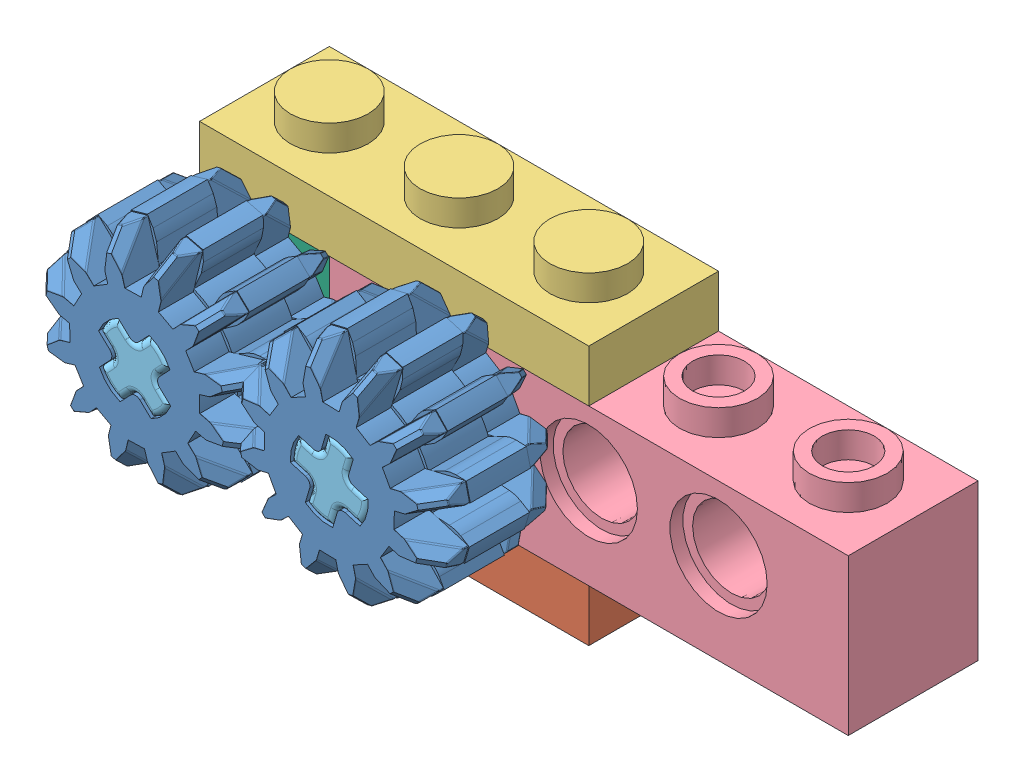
SolidWorks assembly 13.2.SLDASM, configuration Default (file format 11000). Lengths in mm.
Overall size (45.38 18.75 16.06).
8 component instances, 6 part files, 21 mates.
Components (placement in the parent):
- 32270 Gear 12 Tooth Double Bevel-1: 32270 Gear 12 Tooth Double Bevel.SLDPRT [Default] at (8.1935 29.068 9.5277) x (0.958991 -0.283437 0) z (0.283437 0.958991 0) size (13.27 8.11 13.27)
- 3626 Plate 1 x 3 Red-1: 3626 Plate 1 x 3 Red.SLDPRT [Default] at (16.1935 20.268 1.5277) size (24 4.8 8)
- 3626 Plate 1 x 3 Teal-1: 3626 Plate 1 x 3 Teal.SLDPRT [Default] at (16.1935 33.068 1.5277) size (24 4.8 8)
- 3701 Brick 1 x 4 with Holes Yellow-1: 3701 Brick 1 x 4 with Holes Yellow.SLDPRT [Default] at (16.1935 28.268 1.5277) size (32 11.2 8)
- 3749 Axle Pin without Friction Ridges Lengthwise-1: 3749 Axle Pin without Friction Ridges Lengthwise.SLDPRT [Default] at (8.1935 29.068 5.5277) x (0.283437 0.958991 0) z (0.958991 -0.283437 0) size (6 16 6)
- 6541 Brick 1 x 1 with Hole Blue-1: 6541 Brick 1 x 1 with Hole Blue.SLDPRT [Default] at (-7.8065 23.468 5.5277) size (8 11.2 8)
- 32270 Gear 12 Tooth Double Bevel-2: 32270 Gear 12 Tooth Double Bevel.SLDPRT [Default] at (-3.8065 29.068 9.5277) x (-0.688746 -0.725003 0) z (0.725003 -0.688746 0) size (13.27 8.11 13.27)
- 3749 Axle Pin without Friction Ridges Lengthwise-2: 3749 Axle Pin without Friction Ridges Lengthwise.SLDPRT [Default] at (-3.8065 29.068 5.5277) x (0.725003 -0.688746 0) z (-0.688746 -0.725003 0) size (6 16 6)
Mates (geometry in assembly coordinates):
- Coincident4: coincident: plane of 3626 Plate 1 x 3 Red-1 through (16.1935 23.468 1.5277) normal (0 1 0); plane of 6541 Brick 1 x 1 with Hole Blue-1 through (-7.8065 23.468 5.5277) normal (0 -1 0)
- Coincident5: coincident: line of 3626 Plate 1 x 3 Red-1 through (-7.8065 23.468 -2.4723) axis (0 0 1); line of 6541 Brick 1 x 1 with Hole Blue-1 through (-7.8065 23.468 -2.4723) axis (0 0 1)
- Coincident6: coincident: line of 3626 Plate 1 x 3 Red-1 through (16.1935 23.468 -2.4723) axis (-1 0 0); line of 6541 Brick 1 x 1 with Hole Blue-1 through (0.1935 23.468 -2.4723) axis (-1 0 0)
- Coincident7: coincident: plane of 3701 Brick 1 x 4 with Holes Yellow-1 through (0.1935 33.068 -2.4723) normal (-1 0 0); plane of 6541 Brick 1 x 1 with Hole Blue-1 through (0.1935 33.068 5.5277) normal (1 0 0)
- Coincident8: coincident: plane of 3626 Plate 1 x 3 Red-1 through (16.1935 23.468 1.5277) normal (0 1 0); plane of 3701 Brick 1 x 4 with Holes Yellow-1 through (0.1935 23.468 -2.4723) normal (0 -1 0)
- Coincident9: coincident: line of 3626 Plate 1 x 3 Red-1 through (-7.8065 23.468 5.5277) axis (1 0 0); line of 3701 Brick 1 x 4 with Holes Yellow-1 through (0.1935 23.468 5.5277) axis (1 0 0)
- Coincident10: coincident: plane of 3626 Plate 1 x 3 Teal-1 through (16.1935 33.068 1.5277) normal (0 -1 0); plane of 6541 Brick 1 x 1 with Hole Blue-1 through (-7.8065 33.068 5.5277) normal (0 1 0)
- Parallel1: parallel: line of 3626 Plate 1 x 3 Teal-1 through (-7.8065 33.068 -2.4723) axis (0 0 1); line of 6541 Brick 1 x 1 with Hole Blue-1 through (-7.8065 33.068 -2.4723) axis (0 0 1)
- Coincident12: coincident: line of 3626 Plate 1 x 3 Teal-1 through (-7.8065 33.068 5.5277) axis (1 0 0); line of 6541 Brick 1 x 1 with Hole Blue-1 through (-7.8065 33.068 5.5277) axis (1 0 0)
- Coincident13: coincident: plane of 3626 Plate 1 x 3 Teal-1 through (-7.8065 36.268 5.5277) normal (-1 0 0); plane of 6541 Brick 1 x 1 with Hole Blue-1 through (-7.8065 33.068 5.5277) normal (-1 0 0)
- Concentric1: concentric: cylinder of 6541 Brick 1 x 1 with Hole Blue-1 through (-3.8065 29.068 -6.2723) axis (0 0 1) radius 2.4; cylinder of 3749 Axle Pin without Friction Ridges Lengthwise-2 through (-3.8065 29.068 -2.4723) axis (0 0 1) radius 2.4
- Coincident14: coincident: plane of 6541 Brick 1 x 1 with Hole Blue-1 through (-3.8065 29.068 4.7277) normal (0 0 1); plane of 3749 Axle Pin without Friction Ridges Lengthwise-2 through (-3.8065 29.068 4.7277) normal (0 0 -1)
- Concentric2: concentric: cylinder of 3701 Brick 1 x 4 with Holes Yellow-1 through (8.1935 29.068 -2.4723) axis (0 0 1) radius 2.4; cylinder of 3749 Axle Pin without Friction Ridges Lengthwise-1 through (8.1935 29.068 -2.4723) axis (0 0 1) radius 2.4
- Coincident15: coincident: plane of 3701 Brick 1 x 4 with Holes Yellow-1 through (8.1935 29.068 4.7277) normal (0 0 1); plane of 3749 Axle Pin without Friction Ridges Lengthwise-1 through (8.1935 29.068 4.7277) normal (0 0 -1)
- Concentric3: concentric: cylinder of 32270 Gear 12 Tooth Double Bevel-2 through (-3.8065 29.068 13.5852) axis (0 0 -1) radius 2.4; cylinder of 3749 Axle Pin without Friction Ridges Lengthwise-2 through (-3.8065 29.068 13.5277) axis (0 0 -1) radius 2.4
- Coincident16: coincident: plane of 32270 Gear 12 Tooth Double Bevel-2 through (-5.3571 29.1591 13.5852) normal (0.613893 0.789389 0); plane of 3749 Axle Pin without Friction Ridges Lengthwise-2 through (-6.1093 29.7441 13.5277) normal (-0.613893 -0.789389 0)
- Coincident17: coincident: plane of 6541 Brick 1 x 1 with Hole Blue-1 through (-7.8065 33.068 5.5277) normal (0 0 1); plane of 32270 Gear 12 Tooth Double Bevel-2 through (-3.8065 29.068 5.5277) normal (0 0 -1)
- Concentric4: concentric: cylinder of 32270 Gear 12 Tooth Double Bevel-1 through (8.1935 29.068 13.5852) axis (0 0 -1) radius 2.4; cylinder of 3749 Axle Pin without Friction Ridges Lengthwise-1 through (8.1935 29.068 13.5277) axis (0 0 -1) radius 2.4
- Coincident18: coincident: plane of 32270 Gear 12 Tooth Double Bevel-1 through (6.6463 29.2053 13.5852) normal (0.637123 0.770762 0); plane of 3749 Axle Pin without Friction Ridges Lengthwise-1 through (5.9118 29.8123 13.5277) normal (-0.637123 -0.770762 0)
- Coincident19: coincident: plane of 32270 Gear 12 Tooth Double Bevel-1 through (8.1935 29.068 5.5277) normal (0 0 -1); plane of 3701 Brick 1 x 4 with Holes Yellow-1 through (16.1935 28.268 5.5277) normal (0 0 1)
- GearMate1: gear = 8.065 mm: circle of 32270 Gear 12 Tooth Double Bevel-1; circle of 32270 Gear 12 Tooth Double Bevel-2
